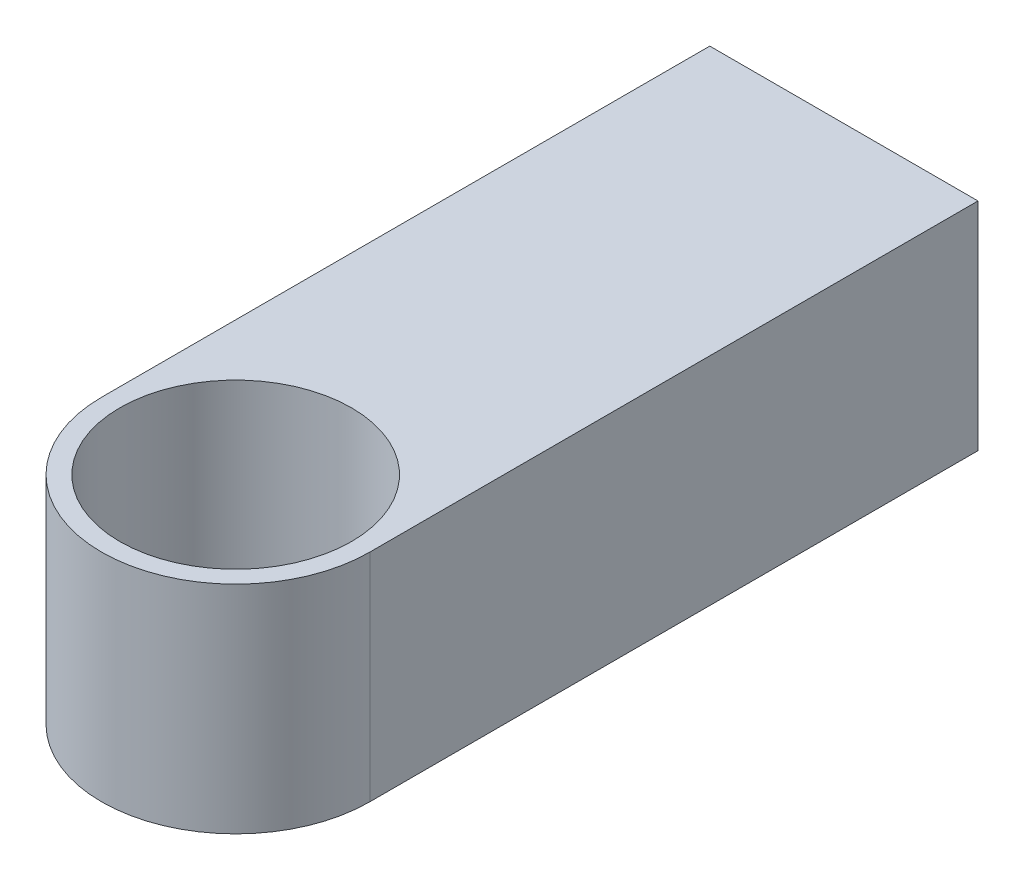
from build123d import *

# Parameters (mm, degrees)
BOSS_EXTRUDE3_REACH             = 37.896
BOSS_EXTRUDE3_DIRECTION_2_REACH = 37.896


with BuildPart() as part:
    # Sketch1 → Revolve2 (revolve)
    with BuildSketch(Plane.XY, mode=Mode.PRIVATE) as revolve2_sk:
        Polygon((0, 0), (22.05, 0), (22.05, 35.56), (19.05, 35.56), (19.05, 3), (3, 3), (0, 3), align=None)
    revolve(revolve2_sk.sketch.rotate(Axis((0, 35.56, 0), (0, -1, 0)), 180), axis=Axis((0, 35.56, 0), (0, -1, 0)))

    # Boss-Extrude3: up to this face of the body (flat: up to its plane)
    boss_extrude3_end = Plane(part.part.faces().sort_by_distance((0, 0, 0))[0])
    # Sketch5 → Boss-Extrude3 (add, up to the picked face)
    with BuildSketch(Plane(origin=(0, 17.78, 0), x_dir=(-1, 0, 0), z_dir=(0, -1, 0)), mode=Mode.PRIVATE) as boss_extrude3_sk1:
        with BuildLine():
            Line((22.05, 0), (22.05, 100))
            Line((22.05, 100), (-22.05, 100))
            Line((-22.05, 100), (-22.05, 0))
            ThreePointArc((-22.05, 0), (0, 22.05), (22.05, 0))
        make_face()
    boss_extrude3_tool1 = split(extrude(boss_extrude3_sk1.sketch, amount=BOSS_EXTRUDE3_REACH, mode=Mode.PRIVATE), bisect_by=boss_extrude3_end, keep=Keep.BOTH, mode=Mode.PRIVATE)
    add(boss_extrude3_tool1.solids().sort_by(Axis((0, 17.78, -58.512545), (0, -1, 0)))[0])

    # Boss-Extrude3 direction 2: up to this face of the body (flat: up to its plane)
    boss_extrude3_direction_2_end = Plane(part.part.faces().sort_by_distance((21.426331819, 35.56, 0))[0])
    # Sketch5 → Boss-Extrude3 direction 2 (add, up to the picked face)
    with BuildSketch(Plane(origin=(0, 17.78, 0), x_dir=(-1, 0, 0), z_dir=(0, -1, 0)), mode=Mode.PRIVATE) as boss_extrude3_direction_2_sk1:
        with BuildLine():
            Line((22.05, 0), (22.05, 100))
            Line((22.05, 100), (-22.05, 100))
            Line((-22.05, 100), (-22.05, 0))
            ThreePointArc((-22.05, 0), (0, 22.05), (22.05, 0))
        make_face()
    boss_extrude3_direction_2_tool1 = split(extrude(boss_extrude3_direction_2_sk1.sketch, amount=-BOSS_EXTRUDE3_DIRECTION_2_REACH, mode=Mode.PRIVATE), bisect_by=boss_extrude3_direction_2_end, keep=Keep.BOTH, mode=Mode.PRIVATE)
    add(boss_extrude3_direction_2_tool1.solids().sort_by(Axis((0, 17.78, -58.512545), (0, 1, 0)))[0])


solid = part.part
